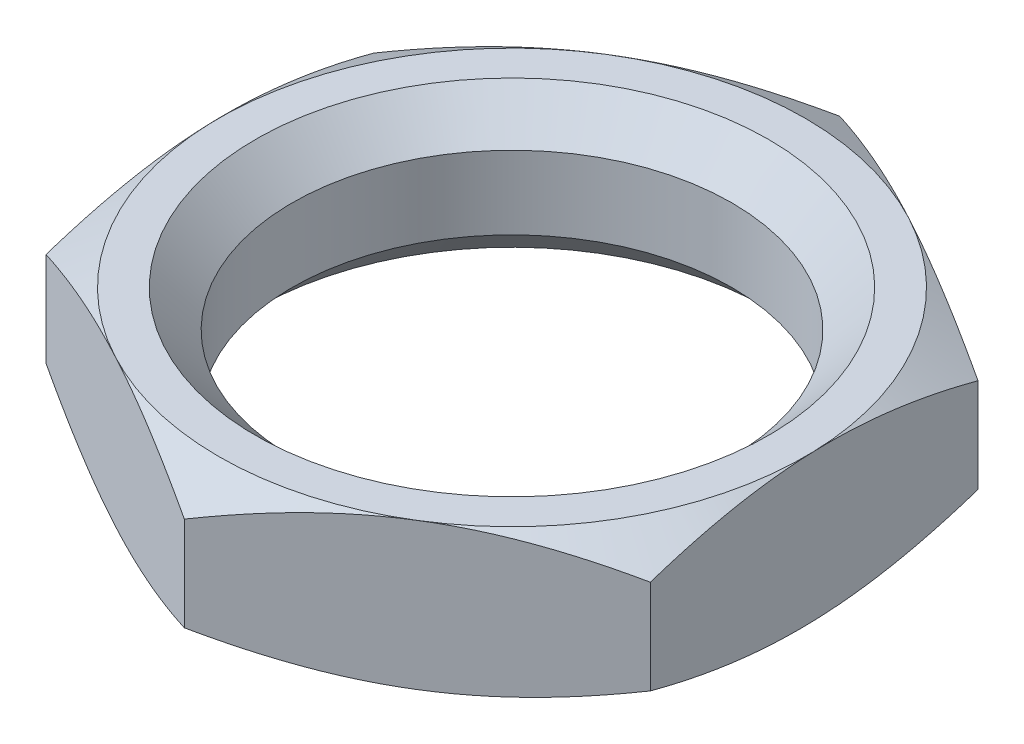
from build123d import *

# Parameters (mm, degrees)
EXTRUDE1_DEPTH         = 4
M14X2_0_TAPPED_HOLE1_D = 12
CHAMFER1_SIZE          = 1


with BuildPart() as part:
    # Sketch1 → Extrude1 (new body)
    with BuildSketch(Plane(origin=(0, 0, 0), x_dir=(1, 0, 0), z_dir=(0, 1, 0))):
        Polygon((7.851064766, 4.867660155), (-0.289984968, 9.233051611), (-8.141049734, 4.365391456), (-7.851064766, -4.867660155), (0.289984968, -9.233051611), (8.141049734, -4.365391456), align=None)
    extrude(amount=EXTRUDE1_DEPTH)

    # M14x2.0 Tapped Hole1 (through all)
    with Locations(Plane.ZX.offset(4)):
        with Locations((0, 0)):
            Hole(M14X2_0_TAPPED_HOLE1_D / 2)

    # Chamfer1
    chamfer1_edges = [part.edges().sort_by_distance(p)[0] for p in [
        (0, 4, 6),
        (0, 0, 6),
    ]]
    chamfer(chamfer1_edges, length=CHAMFER1_SIZE)

    # Sketch13 → Cut-Revolve1 (revolve, cut)
    with BuildSketch(Plane(origin=(0, 0, 0), x_dir=(-0.9995071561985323, 0, 0.03139179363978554), z_dir=(-0.03139179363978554, 0, -0.9995071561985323))):
        Polygon((-8, 4), (-11, 4), (-11, 2.267949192), align=None)
        Polygon((-8, 0), (-11, 0), (-11, 1.732050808), align=None)
    revolve(axis=Axis((0, 2.267949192, 0), (0, 1, 0)), mode=Mode.SUBTRACT)


solid = part.part
